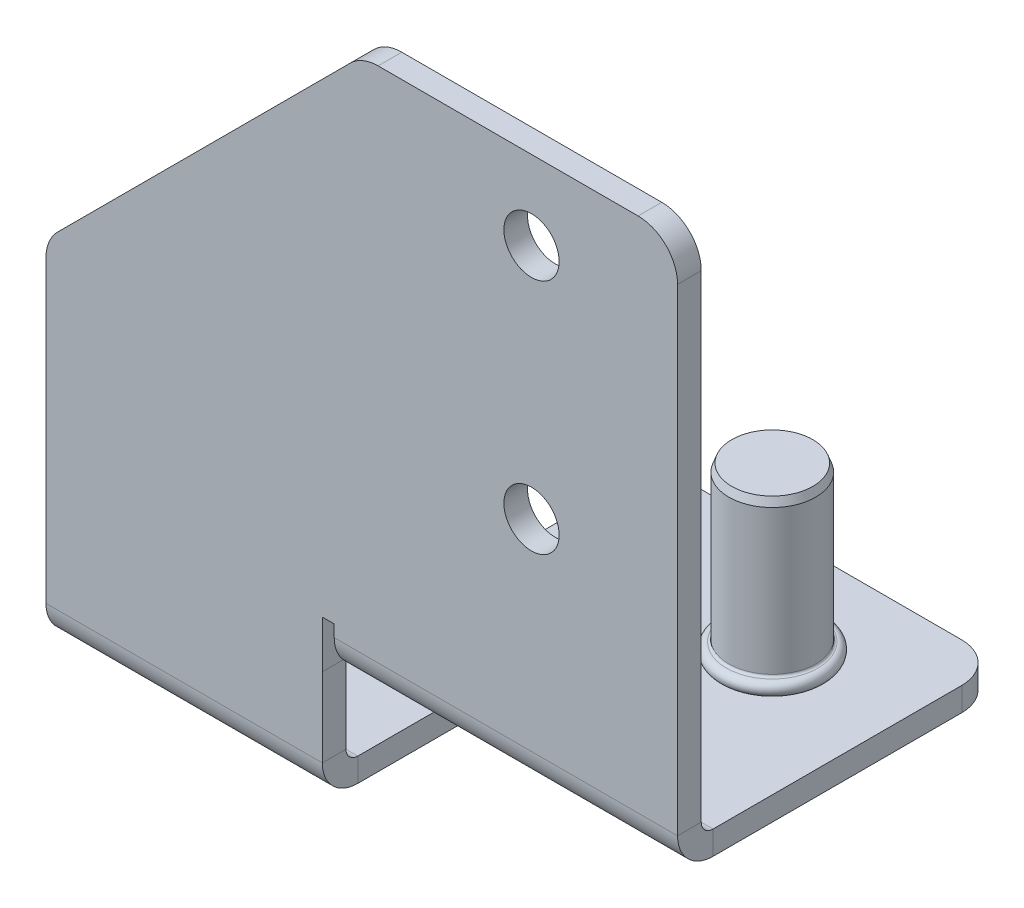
ISO-10303-21;
HEADER;
FILE_DESCRIPTION(('STEP AP214'),'2;1');
FILE_NAME('part.step','',(''),(''),'','','');
FILE_SCHEMA(('AUTOMOTIVE_DESIGN { 1 0 10303 214 1 1 1 1 }'));
ENDSEC;
DATA;
#1=APPLICATION_CONTEXT('core data for automotive mechanical design processes');
#2=APPLICATION_PROTOCOL_DEFINITION('international standard','automotive_design',2000,#1);
#3=PRODUCT_CONTEXT('',#1,'mechanical');
#4=PRODUCT('Part','Part','',(#3));
#5=PRODUCT_RELATED_PRODUCT_CATEGORY('part','',(#4));
#6=PRODUCT_DEFINITION_FORMATION('','',#4);
#7=PRODUCT_DEFINITION_CONTEXT('part definition',#1,'design');
#8=PRODUCT_DEFINITION('design','',#6,#7);
#9=PRODUCT_DEFINITION_SHAPE('','',#8);
#10=(LENGTH_UNIT() NAMED_UNIT(*) SI_UNIT(.MILLI.,.METRE.));
#11=(NAMED_UNIT(*) PLANE_ANGLE_UNIT() SI_UNIT($,.RADIAN.));
#12=(NAMED_UNIT(*) SI_UNIT($,.STERADIAN.) SOLID_ANGLE_UNIT());
#13=UNCERTAINTY_MEASURE_WITH_UNIT(LENGTH_MEASURE(1.E-05),#10,'distance_accuracy_value','');
#14=(GEOMETRIC_REPRESENTATION_CONTEXT(3) GLOBAL_UNCERTAINTY_ASSIGNED_CONTEXT((#13)) GLOBAL_UNIT_ASSIGNED_CONTEXT((#10,
#11,#12)) REPRESENTATION_CONTEXT('',''));
#15=CARTESIAN_POINT('',(0.,0.,0.));
#16=DIRECTION('',(0.,0.,1.));
#17=DIRECTION('',(1.,0.,0.));
#18=AXIS2_PLACEMENT_3D('',#15,#16,#17);
#19=CARTESIAN_POINT('',(25.,-13.3199999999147,-27.));
#20=DIRECTION('',(0.,-1.,0.));
#21=DIRECTION('',(0.,0.,1.));
#22=AXIS2_PLACEMENT_3D('',#19,#20,#21);
#23=CONICAL_SURFACE('',#22,3.15874999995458,1.04719755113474);
#24=CARTESIAN_POINT('',(24.9999999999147,-11.4962948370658,-27.));
#25=VERTEX_POINT('',#24);
#26=VERTEX_LOOP('',#25);
#27=FACE_BOUND('',#26,.T.);
#28=CARTESIAN_POINT('',(25.,-13.3200000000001,-27.));
#29=DIRECTION('',(0.,1.,0.));
#30=DIRECTION('',(0.,0.,-1.));
#31=AXIS2_PLACEMENT_3D('',#28,#29,#30);
#32=CIRCLE('',#31,3.15875);
#33=CARTESIAN_POINT('',(25.,-13.3200000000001,-30.15875));
#34=VERTEX_POINT('',#33);
#35=EDGE_CURVE('E125',#34,#34,#32,.F.);
#36=ORIENTED_EDGE('',*,*,#35,.T.);
#37=EDGE_LOOP('',(#36));
#38=FACE_BOUND('',#37,.T.);
#39=ADVANCED_FACE('F91',(#27,#38),#23,.F.);
#40=CARTESIAN_POINT('',(25.,-14.7976250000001,-27.));
#41=DIRECTION('',(0.,1.,0.));
#42=DIRECTION('',(0.,0.,-1.));
#43=AXIS2_PLACEMENT_3D('',#40,#41,#42);
#44=CYLINDRICAL_SURFACE('',#43,3.15875);
#45=CARTESIAN_POINT('',(25.,-16.275250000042,-27.));
#46=DIRECTION('',(0.,-1.,0.));
#47=DIRECTION('',(-1.,0.,0.));
#48=AXIS2_PLACEMENT_3D('',#45,#46,#47);
#49=CIRCLE('',#48,3.15874999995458);
#50=CARTESIAN_POINT('',(21.8412500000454,-16.275250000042,-27.));
#51=VERTEX_POINT('',#50);
#52=EDGE_CURVE('E127',#51,#51,#49,.T.);
#53=ORIENTED_EDGE('',*,*,#52,.T.);
#54=EDGE_LOOP('',(#53));
#55=FACE_BOUND('',#54,.T.);
#56=ORIENTED_EDGE('',*,*,#35,.F.);
#57=EDGE_LOOP('',(#56));
#58=FACE_BOUND('',#57,.T.);
#59=ADVANCED_FACE('F122',(#55,#58),#44,.F.);
#60=CARTESIAN_POINT('',(25.,-16.4399999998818,-27.));
#61=DIRECTION('',(0.,-1.,0.));
#62=DIRECTION('',(0.,0.,1.));
#63=AXIS2_PLACEMENT_3D('',#60,#61,#62);
#64=CONICAL_SURFACE('',#63,3.32349999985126,0.785398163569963);
#65=CARTESIAN_POINT('',(25.,-16.4400000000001,-27.));
#66=DIRECTION('',(0.,1.,0.));
#67=DIRECTION('',(0.,0.,-1.));
#68=AXIS2_PLACEMENT_3D('',#65,#66,#67);
#69=CIRCLE('',#68,3.3235);
#70=CARTESIAN_POINT('',(25.,-16.4400000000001,-30.3235));
#71=VERTEX_POINT('',#70);
#72=EDGE_CURVE('E130',#71,#71,#69,.F.);
#73=ORIENTED_EDGE('',*,*,#72,.T.);
#74=EDGE_LOOP('',(#73));
#75=FACE_BOUND('',#74,.T.);
#76=ORIENTED_EDGE('',*,*,#52,.F.);
#77=EDGE_LOOP('',(#76));
#78=FACE_BOUND('',#77,.T.);
#79=ADVANCED_FACE('F213',(#75,#78),#64,.F.);
#80=CARTESIAN_POINT('',(25.,-23.3817500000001,-27.));
#81=DIRECTION('',(0.,1.,0.));
#82=DIRECTION('',(0.,0.,-1.));
#83=AXIS2_PLACEMENT_3D('',#80,#81,#82);
#84=CYLINDRICAL_SURFACE('',#83,3.3235);
#85=CARTESIAN_POINT('',(25.,-30.2341448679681,-27.));
#86=DIRECTION('',(0.,-1.,0.));
#87=DIRECTION('',(-1.,0.,0.));
#88=AXIS2_PLACEMENT_3D('',#85,#86,#87);
#89=CIRCLE('',#88,3.3235000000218);
#90=CARTESIAN_POINT('',(21.6764999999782,-30.2341448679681,-27.));
#91=VERTEX_POINT('',#90);
#92=EDGE_CURVE('E208',#91,#91,#89,.T.);
#93=ORIENTED_EDGE('',*,*,#92,.T.);
#94=EDGE_LOOP('',(#93));
#95=FACE_BOUND('',#94,.T.);
#96=ORIENTED_EDGE('',*,*,#72,.F.);
#97=EDGE_LOOP('',(#96));
#98=FACE_BOUND('',#97,.T.);
#99=ADVANCED_FACE('F216',(#95,#98),#84,.F.);
#100=CARTESIAN_POINT('',(25.,-31.0000000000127,-27.));
#101=DIRECTION('',(0.,-1.,0.));
#102=DIRECTION('',(0.,0.,1.));
#103=AXIS2_PLACEMENT_3D('',#100,#101,#102);
#104=CONICAL_SURFACE('',#103,4.64999999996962,1.04719755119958);
#105=CARTESIAN_POINT('',(25.,-31.0000000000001,-27.));
#106=DIRECTION('',(0.,-1.,0.));
#107=DIRECTION('',(0.,0.,1.));
#108=AXIS2_PLACEMENT_3D('',#105,#106,#107);
#109=CIRCLE('',#108,4.65);
#110=CARTESIAN_POINT('',(25.,-31.0000000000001,-22.35));
#111=VERTEX_POINT('',#110);
#112=EDGE_CURVE('E148',#111,#111,#109,.T.);
#113=ORIENTED_EDGE('',*,*,#112,.T.);
#114=EDGE_LOOP('',(#113));
#115=FACE_BOUND('',#114,.T.);
#116=ORIENTED_EDGE('',*,*,#92,.F.);
#117=EDGE_LOOP('',(#116));
#118=FACE_BOUND('',#117,.T.);
#119=ADVANCED_FACE('F218',(#115,#118),#104,.F.);
#120=CARTESIAN_POINT('',(25.,-35.0000000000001,-27.));
#121=DIRECTION('',(0.,-1.,0.));
#122=DIRECTION('',(0.,0.,1.));
#123=AXIS2_PLACEMENT_3D('',#120,#121,#122);
#124=CYLINDRICAL_SURFACE('',#123,4.65);
#125=ORIENTED_EDGE('',*,*,#112,.F.);
#126=EDGE_LOOP('',(#125));
#127=FACE_BOUND('',#126,.T.);
#128=CARTESIAN_POINT('',(25.,-35.0000000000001,-27.));
#129=DIRECTION('',(0.,-1.,0.));
#130=DIRECTION('',(0.,0.,1.));
#131=AXIS2_PLACEMENT_3D('',#128,#129,#130);
#132=CIRCLE('',#131,4.65);
#133=CARTESIAN_POINT('',(25.,-35.0000000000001,-22.35));
#134=VERTEX_POINT('',#133);
#135=EDGE_CURVE('E145',#134,#134,#132,.T.);
#136=ORIENTED_EDGE('',*,*,#135,.T.);
#137=EDGE_LOOP('',(#136));
#138=FACE_BOUND('',#137,.T.);
#139=ADVANCED_FACE('F225',(#127,#138),#124,.F.);
#140=CARTESIAN_POINT('',(25.,-35.0000000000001,-27.));
#141=DIRECTION('',(0.,1.,0.));
#142=DIRECTION('',(0.,0.,-1.));
#143=AXIS2_PLACEMENT_3D('',#140,#141,#142);
#144=PLANE('',#143);
#145=ORIENTED_EDGE('',*,*,#135,.F.);
#146=EDGE_LOOP('',(#145));
#147=FACE_BOUND('',#146,.T.);
#148=CARTESIAN_POINT('',(25.,-34.999999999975,-27.));
#149=DIRECTION('',(0.,-1.,0.));
#150=DIRECTION('',(0.,0.,1.));
#151=AXIS2_PLACEMENT_3D('',#148,#149,#150);
#152=CIRCLE('',#151,5.99999999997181);
#153=CARTESIAN_POINT('',(25.,-34.999999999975,-21.0000000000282));
#154=VERTEX_POINT('',#153);
#155=EDGE_CURVE('E142',#154,#154,#152,.F.);
#156=ORIENTED_EDGE('',*,*,#155,.F.);
#157=EDGE_LOOP('',(#156));
#158=FACE_BOUND('',#157,.T.);
#159=ADVANCED_FACE('F286',(#147,#158),#144,.F.);
#160=CARTESIAN_POINT('',(25.,-34.999999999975,-27.));
#161=DIRECTION('',(0.,-1.,0.));
#162=DIRECTION('',(0.,0.,1.));
#163=AXIS2_PLACEMENT_3D('',#160,#161,#162);
#164=CONICAL_SURFACE('',#163,5.99999999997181,0.89605538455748);
#165=ORIENTED_EDGE('',*,*,#155,.T.);
#166=EDGE_LOOP('',(#165));
#167=FACE_BOUND('',#166,.T.);
#168=CARTESIAN_POINT('',(25.,-34.6000000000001,-27.));
#169=DIRECTION('',(0.,-1.,0.));
#170=DIRECTION('',(0.,0.,1.));
#171=AXIS2_PLACEMENT_3D('',#168,#169,#170);
#172=CIRCLE('',#171,5.5);
#173=CARTESIAN_POINT('',(25.,-34.6000000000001,-21.5));
#174=VERTEX_POINT('',#173);
#175=EDGE_CURVE('E141',#174,#174,#172,.F.);
#176=ORIENTED_EDGE('',*,*,#175,.F.);
#177=EDGE_LOOP('',(#176));
#178=FACE_BOUND('',#177,.T.);
#179=ADVANCED_FACE('F279',(#167,#178),#164,.T.);
#180=CARTESIAN_POINT('',(25.,-34.9000000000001,-27.));
#181=DIRECTION('',(0.,-1.,0.));
#182=DIRECTION('',(0.,0.,1.));
#183=AXIS2_PLACEMENT_3D('',#180,#181,#182);
#184=CYLINDRICAL_SURFACE('',#183,5.5);
#185=ORIENTED_EDGE('',*,*,#175,.T.);
#186=EDGE_LOOP('',(#185));
#187=FACE_BOUND('',#186,.T.);
#188=CARTESIAN_POINT('',(25.,-31.9000000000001,-27.));
#189=DIRECTION('',(0.,-1.,0.));
#190=DIRECTION('',(0.,0.,1.));
#191=AXIS2_PLACEMENT_3D('',#188,#189,#190);
#192=CIRCLE('',#191,5.5);
#193=CARTESIAN_POINT('',(25.,-31.9000000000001,-21.5));
#194=VERTEX_POINT('',#193);
#195=EDGE_CURVE('E138',#194,#194,#192,.F.);
#196=ORIENTED_EDGE('',*,*,#195,.F.);
#197=EDGE_LOOP('',(#196));
#198=FACE_BOUND('',#197,.T.);
#199=ADVANCED_FACE('F272',(#187,#198),#184,.T.);
#200=CARTESIAN_POINT('',(22.1,-31.9000000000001,-27.));
#201=DIRECTION('',(0.,-1.,0.));
#202=DIRECTION('',(0.,0.,1.));
#203=AXIS2_PLACEMENT_3D('',#200,#201,#202);
#204=PLANE('',#203);
#205=CARTESIAN_POINT('',(25.,-31.9000000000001,-27.));
#206=DIRECTION('',(0.,1.,0.));
#207=DIRECTION('',(0.,0.,1.));
#208=AXIS2_PLACEMENT_3D('',#205,#206,#207);
#209=CIRCLE('',#208,5.80000000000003);
#210=CARTESIAN_POINT('',(25.,-31.9000000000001,-21.1999999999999));
#211=VERTEX_POINT('',#210);
#212=CARTESIAN_POINT('',(25.,-31.9000000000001,-32.8));
#213=VERTEX_POINT('',#212);
#214=EDGE_CURVE('E110',#211,#213,#209,.T.);
#215=ORIENTED_EDGE('',*,*,#214,.F.);
#216=CARTESIAN_POINT('',(25.,-31.9000000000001,-27.));
#217=DIRECTION('',(0.,1.,0.));
#218=DIRECTION('',(-1.,0.,0.));
#219=AXIS2_PLACEMENT_3D('',#216,#217,#218);
#220=CIRCLE('',#219,5.80000000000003);
#221=CARTESIAN_POINT('',(19.2,-31.9000000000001,-27.));
#222=VERTEX_POINT('',#221);
#223=EDGE_CURVE('E150',#222,#211,#220,.T.);
#224=ORIENTED_EDGE('',*,*,#223,.F.);
#225=CARTESIAN_POINT('',(25.,-31.9000000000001,-27.));
#226=DIRECTION('',(0.,1.,0.));
#227=DIRECTION('',(0.,0.,-1.));
#228=AXIS2_PLACEMENT_3D('',#225,#226,#227);
#229=CIRCLE('',#228,5.80000000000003);
#230=EDGE_CURVE('E178',#213,#222,#229,.T.);
#231=ORIENTED_EDGE('',*,*,#230,.F.);
#232=EDGE_LOOP('',(#215,#224,#231));
#233=FACE_BOUND('',#232,.T.);
#234=ORIENTED_EDGE('',*,*,#195,.T.);
#235=EDGE_LOOP('',(#234));
#236=FACE_BOUND('',#235,.T.);
#237=ADVANCED_FACE('F167',(#233,#236),#204,.T.);
#238=CARTESIAN_POINT('',(25.,-31.0500000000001,-27.));
#239=DIRECTION('',(0.,-1.,0.));
#240=DIRECTION('',(0.,0.,1.));
#241=AXIS2_PLACEMENT_3D('',#238,#239,#240);
#242=TOROIDAL_SURFACE('',#241,5.80000000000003,0.85);
#243=ORIENTED_EDGE('',*,*,#214,.T.);
#244=ORIENTED_EDGE('',*,*,#230,.T.);
#245=ORIENTED_EDGE('',*,*,#223,.T.);
#246=EDGE_LOOP('',(#243,#244,#245));
#247=FACE_BOUND('',#246,.T.);
#248=CARTESIAN_POINT('',(25.,-30.2000000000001,-27.));
#249=DIRECTION('',(0.,-1.,0.));
#250=DIRECTION('',(0.,0.,1.));
#251=AXIS2_PLACEMENT_3D('',#248,#249,#250);
#252=CIRCLE('',#251,5.8);
#253=CARTESIAN_POINT('',(25.,-30.2000000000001,-21.2));
#254=VERTEX_POINT('',#253);
#255=EDGE_CURVE('E137',#254,#254,#252,.T.);
#256=ORIENTED_EDGE('',*,*,#255,.T.);
#257=EDGE_LOOP('',(#256));
#258=FACE_BOUND('',#257,.T.);
#259=ADVANCED_FACE('F155',(#247,#258),#242,.T.);
#260=CARTESIAN_POINT('',(25.,-10.6000000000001,-27.));
#261=DIRECTION('',(0.,1.,0.));
#262=DIRECTION('',(0.,0.,-1.));
#263=AXIS2_PLACEMENT_3D('',#260,#261,#262);
#264=PLANE('',#263);
#265=CARTESIAN_POINT('',(25.,-10.6000000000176,-27.));
#266=DIRECTION('',(0.,-1.,0.));
#267=DIRECTION('',(0.,0.,1.));
#268=AXIS2_PLACEMENT_3D('',#265,#266,#267);
#269=CIRCLE('',#268,5.13602976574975);
#270=CARTESIAN_POINT('',(25.,-10.6000000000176,-21.8639702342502));
#271=VERTEX_POINT('',#270);
#272=EDGE_CURVE('E134',#271,#271,#269,.T.);
#273=ORIENTED_EDGE('',*,*,#272,.F.);
#274=EDGE_LOOP('',(#273));
#275=FACE_BOUND('',#274,.T.);
#276=ADVANCED_FACE('F166',(#275),#264,.T.);
#277=CARTESIAN_POINT('',(25.,-29.9000000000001,-27.));
#278=DIRECTION('',(0.,-1.,0.));
#279=DIRECTION('',(0.,0.,1.));
#280=AXIS2_PLACEMENT_3D('',#277,#278,#279);
#281=TOROIDAL_SURFACE('',#280,5.80000000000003,0.299999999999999);
#282=ORIENTED_EDGE('',*,*,#255,.F.);
#283=EDGE_LOOP('',(#282));
#284=FACE_BOUND('',#283,.T.);
#285=CARTESIAN_POINT('',(25.,-29.9000000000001,-27.));
#286=DIRECTION('',(0.,-1.,0.));
#287=DIRECTION('',(0.,0.,1.));
#288=AXIS2_PLACEMENT_3D('',#285,#286,#287);
#289=CIRCLE('',#288,5.5);
#290=CARTESIAN_POINT('',(25.,-29.9000000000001,-21.5));
#291=VERTEX_POINT('',#290);
#292=EDGE_CURVE('E102',#291,#291,#289,.F.);
#293=ORIENTED_EDGE('',*,*,#292,.F.);
#294=EDGE_LOOP('',(#293));
#295=FACE_BOUND('',#294,.T.);
#296=ADVANCED_FACE('F237',(#284,#295),#281,.F.);
#297=CARTESIAN_POINT('',(25.,-11.5999999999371,-27.));
#298=DIRECTION('',(0.,-1.,0.));
#299=DIRECTION('',(0.,0.,1.));
#300=AXIS2_PLACEMENT_3D('',#297,#298,#299);
#301=CONICAL_SURFACE('',#300,5.49999999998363,0.349065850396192);
#302=ORIENTED_EDGE('',*,*,#272,.T.);
#303=EDGE_LOOP('',(#302));
#304=FACE_BOUND('',#303,.T.);
#305=CARTESIAN_POINT('',(25.,-11.6000000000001,-27.));
#306=DIRECTION('',(0.,-1.,0.));
#307=DIRECTION('',(0.,0.,1.));
#308=AXIS2_PLACEMENT_3D('',#305,#306,#307);
#309=CIRCLE('',#308,5.5);
#310=CARTESIAN_POINT('',(25.,-11.6000000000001,-21.5));
#311=VERTEX_POINT('',#310);
#312=EDGE_CURVE('E14',#311,#311,#309,.T.);
#313=ORIENTED_EDGE('',*,*,#312,.F.);
#314=EDGE_LOOP('',(#313));
#315=FACE_BOUND('',#314,.T.);
#316=ADVANCED_FACE('F231',(#304,#315),#301,.T.);
#317=CARTESIAN_POINT('',(25.,-34.9000000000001,-27.));
#318=DIRECTION('',(0.,-1.,0.));
#319=DIRECTION('',(0.,0.,1.));
#320=AXIS2_PLACEMENT_3D('',#317,#318,#319);
#321=CYLINDRICAL_SURFACE('',#320,5.5);
#322=ORIENTED_EDGE('',*,*,#292,.T.);
#323=EDGE_LOOP('',(#322));
#324=FACE_BOUND('',#323,.T.);
#325=ORIENTED_EDGE('',*,*,#312,.T.);
#326=EDGE_LOOP('',(#325));
#327=FACE_BOUND('',#326,.T.);
#328=ADVANCED_FACE('F229',(#324,#327),#321,.T.);
#329=CLOSED_SHELL('',(#39,#59,#79,#99,#119,#139,#159,#179,#199,#237,#259,#276,#296,#316,#328));
#330=MANIFOLD_SOLID_BREP('B2',#329);
#331=CARTESIAN_POINT('',(0.,0.,-3.));
#332=DIRECTION('',(0.,0.,-1.));
#333=DIRECTION('',(-1.,0.,0.));
#334=AXIS2_PLACEMENT_3D('',#331,#332,#333);
#335=PLANE('',#334);
#336=CARTESIAN_POINT('',(21.5,25.,-3.));
#337=DIRECTION('',(0.,0.,-1.));
#338=DIRECTION('',(-1.,0.,0.));
#339=AXIS2_PLACEMENT_3D('',#336,#337,#338);
#340=CIRCLE('',#339,3.49999999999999);
#341=CARTESIAN_POINT('',(18.,25.,-3.));
#342=VERTEX_POINT('',#341);
#343=EDGE_CURVE('E750',#342,#342,#340,.T.);
#344=ORIENTED_EDGE('',*,*,#343,.F.);
#345=EDGE_LOOP('',(#344));
#346=FACE_BOUND('',#345,.T.);
#347=CARTESIAN_POINT('',(21.5,-5.,-3.));
#348=DIRECTION('',(0.,0.,-1.));
#349=DIRECTION('',(-1.,0.,0.));
#350=AXIS2_PLACEMENT_3D('',#347,#348,#349);
#351=CIRCLE('',#350,3.49999999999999);
#352=CARTESIAN_POINT('',(18.,-5.,-3.));
#353=VERTEX_POINT('',#352);
#354=EDGE_CURVE('E756',#353,#353,#351,.T.);
#355=ORIENTED_EDGE('',*,*,#354,.F.);
#356=EDGE_LOOP('',(#355));
#357=FACE_BOUND('',#356,.T.);
#358=DIRECTION('',(-0.707106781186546,-0.707106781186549,0.));
#359=VECTOR('',#358,1.);
#360=CARTESIAN_POINT('',(-17.5,17.5,-3.));
#361=LINE('',#360,#359);
#362=CARTESIAN_POINT('',(-38.5355339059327,-3.53553390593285,-3.));
#363=VERTEX_POINT('',#362);
#364=CARTESIAN_POINT('',(-1.46446609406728,33.5355339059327,-3.));
#365=VERTEX_POINT('',#364);
#366=EDGE_CURVE('E791',#363,#365,#361,.F.);
#367=ORIENTED_EDGE('',*,*,#366,.T.);
#368=CARTESIAN_POINT('',(2.07106781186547,30.,-3.));
#369=DIRECTION('',(0.,0.,-1.));
#370=DIRECTION('',(-1.,0.,0.));
#371=AXIS2_PLACEMENT_3D('',#368,#369,#370);
#372=CIRCLE('',#371,5.);
#373=CARTESIAN_POINT('',(2.07106781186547,35.,-3.));
#374=VERTEX_POINT('',#373);
#375=EDGE_CURVE('E849',#365,#374,#372,.T.);
#376=ORIENTED_EDGE('',*,*,#375,.T.);
#377=DIRECTION('',(-1.,0.,0.));
#378=VECTOR('',#377,1.);
#379=CARTESIAN_POINT('',(-40.,35.,-3.));
#380=LINE('',#379,#378);
#381=CARTESIAN_POINT('',(35.,35.,-3.));
#382=VERTEX_POINT('',#381);
#383=EDGE_CURVE('E763',#382,#374,#380,.T.);
#384=ORIENTED_EDGE('',*,*,#383,.F.);
#385=CARTESIAN_POINT('',(35.,30.,-3.));
#386=DIRECTION('',(0.,0.,-1.));
#387=DIRECTION('',(-1.,0.,0.));
#388=AXIS2_PLACEMENT_3D('',#385,#386,#387);
#389=CIRCLE('',#388,5.);
#390=CARTESIAN_POINT('',(40.,30.,-3.));
#391=VERTEX_POINT('',#390);
#392=EDGE_CURVE('E847',#382,#391,#389,.T.);
#393=ORIENTED_EDGE('',*,*,#392,.T.);
#394=DIRECTION('',(0.,1.,0.));
#395=VECTOR('',#394,1.);
#396=CARTESIAN_POINT('',(40.,-35.,-3.));
#397=LINE('',#396,#395);
#398=CARTESIAN_POINT('',(40.,-30.5,-3.));
#399=VERTEX_POINT('',#398);
#400=EDGE_CURVE('E760',#399,#391,#397,.T.);
#401=ORIENTED_EDGE('',*,*,#400,.F.);
#402=DIRECTION('',(-1.,0.,0.));
#403=VECTOR('',#402,1.);
#404=CARTESIAN_POINT('',(-3.49,-30.5,-3.));
#405=LINE('',#404,#403);
#406=CARTESIAN_POINT('',(-3.49,-30.5,-3.));
#407=VERTEX_POINT('',#406);
#408=EDGE_CURVE('E671',#407,#399,#405,.F.);
#409=ORIENTED_EDGE('',*,*,#408,.F.);
#410=DIRECTION('',(0.,-1.,0.));
#411=VECTOR('',#410,1.);
#412=CARTESIAN_POINT('',(-3.49,-29.,-3.));
#413=LINE('',#412,#411);
#414=CARTESIAN_POINT('',(-3.49,-29.,-3.));
#415=VERTEX_POINT('',#414);
#416=EDGE_CURVE('E738',#415,#407,#413,.T.);
#417=ORIENTED_EDGE('',*,*,#416,.F.);
#418=DIRECTION('',(1.,0.,0.));
#419=VECTOR('',#418,1.);
#420=CARTESIAN_POINT('',(-4.99,-29.,-3.));
#421=LINE('',#420,#419);
#422=CARTESIAN_POINT('',(-4.99,-29.,-3.));
#423=VERTEX_POINT('',#422);
#424=EDGE_CURVE('E734',#423,#415,#421,.T.);
#425=ORIENTED_EDGE('',*,*,#424,.F.);
#426=DIRECTION('',(0.,1.,0.));
#427=VECTOR('',#426,1.);
#428=CARTESIAN_POINT('',(-4.99,-35.,-3.));
#429=LINE('',#428,#427);
#430=CARTESIAN_POINT('',(-4.99,-35.,-3.));
#431=VERTEX_POINT('',#430);
#432=EDGE_CURVE('E729',#431,#423,#429,.T.);
#433=ORIENTED_EDGE('',*,*,#432,.F.);
#434=DIRECTION('',(1.,0.,0.));
#435=VECTOR('',#434,1.);
#436=CARTESIAN_POINT('',(-4.99999999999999,-35.,-3.));
#437=LINE('',#436,#435);
#438=CARTESIAN_POINT('',(-4.99999999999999,-35.,-3.));
#439=VERTEX_POINT('',#438);
#440=EDGE_CURVE('E771',#439,#431,#437,.T.);
#441=ORIENTED_EDGE('',*,*,#440,.F.);
#442=DIRECTION('',(0.,1.,0.));
#443=VECTOR('',#442,1.);
#444=CARTESIAN_POINT('',(-4.99999999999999,-35.,-3.));
#445=LINE('',#444,#443);
#446=CARTESIAN_POINT('',(-4.99999999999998,-45.,-3.));
#447=VERTEX_POINT('',#446);
#448=EDGE_CURVE('E769',#447,#439,#445,.T.);
#449=ORIENTED_EDGE('',*,*,#448,.F.);
#450=DIRECTION('',(-1.,0.,0.));
#451=VECTOR('',#450,1.);
#452=CARTESIAN_POINT('',(-40.,-45.,-3.));
#453=LINE('',#452,#451);
#454=CARTESIAN_POINT('',(-40.,-45.,-3.));
#455=VERTEX_POINT('',#454);
#456=EDGE_CURVE('E718',#455,#447,#453,.F.);
#457=ORIENTED_EDGE('',*,*,#456,.F.);
#458=DIRECTION('',(0.,-1.,0.));
#459=VECTOR('',#458,1.);
#460=CARTESIAN_POINT('',(-40.,-35.,-3.));
#461=LINE('',#460,#459);
#462=CARTESIAN_POINT('',(-40.,-7.07106781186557,-3.));
#463=VERTEX_POINT('',#462);
#464=EDGE_CURVE('E767',#463,#455,#461,.T.);
#465=ORIENTED_EDGE('',*,*,#464,.F.);
#466=CARTESIAN_POINT('',(-35.,-7.07106781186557,-3.));
#467=DIRECTION('',(0.,0.,-1.));
#468=DIRECTION('',(-1.,0.,0.));
#469=AXIS2_PLACEMENT_3D('',#466,#467,#468);
#470=CIRCLE('',#469,5.);
#471=EDGE_CURVE('E845',#463,#363,#470,.T.);
#472=ORIENTED_EDGE('',*,*,#471,.T.);
#473=EDGE_LOOP('',(#367,#376,#384,#393,#401,#409,#417,#425,#433,#441,#449,#457,#465,#472));
#474=FACE_BOUND('',#473,.T.);
#475=ADVANCED_FACE('F443',(#346,#357,#474),#335,.T.);
#476=CARTESIAN_POINT('',(0.,0.,0.));
#477=DIRECTION('',(0.,0.,-1.));
#478=DIRECTION('',(-1.,0.,0.));
#479=AXIS2_PLACEMENT_3D('',#476,#477,#478);
#480=PLANE('',#479);
#481=CARTESIAN_POINT('',(21.5,25.,0.));
#482=DIRECTION('',(0.,0.,1.));
#483=DIRECTION('',(1.,0.,0.));
#484=AXIS2_PLACEMENT_3D('',#481,#482,#483);
#485=CIRCLE('',#484,3.5);
#486=CARTESIAN_POINT('',(25.,25.,0.));
#487=VERTEX_POINT('',#486);
#488=EDGE_CURVE('E747',#487,#487,#485,.T.);
#489=ORIENTED_EDGE('',*,*,#488,.F.);
#490=EDGE_LOOP('',(#489));
#491=FACE_BOUND('',#490,.T.);
#492=CARTESIAN_POINT('',(21.5,-5.,0.));
#493=DIRECTION('',(0.,0.,1.));
#494=DIRECTION('',(1.,0.,0.));
#495=AXIS2_PLACEMENT_3D('',#492,#493,#494);
#496=CIRCLE('',#495,3.5);
#497=CARTESIAN_POINT('',(25.,-5.,0.));
#498=VERTEX_POINT('',#497);
#499=EDGE_CURVE('E753',#498,#498,#496,.T.);
#500=ORIENTED_EDGE('',*,*,#499,.F.);
#501=EDGE_LOOP('',(#500));
#502=FACE_BOUND('',#501,.T.);
#503=DIRECTION('',(-1.,0.,0.));
#504=VECTOR('',#503,1.);
#505=CARTESIAN_POINT('',(-40.,35.,0.));
#506=LINE('',#505,#504);
#507=CARTESIAN_POINT('',(35.,35.,0.));
#508=VERTEX_POINT('',#507);
#509=CARTESIAN_POINT('',(2.07106781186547,35.,0.));
#510=VERTEX_POINT('',#509);
#511=EDGE_CURVE('E777',#508,#510,#506,.T.);
#512=ORIENTED_EDGE('',*,*,#511,.T.);
#513=CARTESIAN_POINT('',(2.07106781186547,30.,0.));
#514=DIRECTION('',(0.,0.,-1.));
#515=DIRECTION('',(-1.,0.,0.));
#516=AXIS2_PLACEMENT_3D('',#513,#514,#515);
#517=CIRCLE('',#516,5.);
#518=CARTESIAN_POINT('',(-1.46446609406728,33.5355339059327,0.));
#519=VERTEX_POINT('',#518);
#520=EDGE_CURVE('E839',#510,#519,#517,.F.);
#521=ORIENTED_EDGE('',*,*,#520,.T.);
#522=DIRECTION('',(0.707106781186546,0.707106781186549,0.));
#523=VECTOR('',#522,1.);
#524=CARTESIAN_POINT('',(0.,35.,0.));
#525=LINE('',#524,#523);
#526=CARTESIAN_POINT('',(-38.5355339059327,-3.53553390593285,0.));
#527=VERTEX_POINT('',#526);
#528=EDGE_CURVE('E788',#519,#527,#525,.F.);
#529=ORIENTED_EDGE('',*,*,#528,.T.);
#530=CARTESIAN_POINT('',(-35.,-7.07106781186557,0.));
#531=DIRECTION('',(0.,0.,-1.));
#532=DIRECTION('',(-1.,0.,0.));
#533=AXIS2_PLACEMENT_3D('',#530,#531,#532);
#534=CIRCLE('',#533,5.);
#535=CARTESIAN_POINT('',(-40.,-7.07106781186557,0.));
#536=VERTEX_POINT('',#535);
#537=EDGE_CURVE('E835',#527,#536,#534,.F.);
#538=ORIENTED_EDGE('',*,*,#537,.T.);
#539=DIRECTION('',(0.,-1.,0.));
#540=VECTOR('',#539,1.);
#541=CARTESIAN_POINT('',(-40.,-35.,0.));
#542=LINE('',#541,#540);
#543=CARTESIAN_POINT('',(-40.,-45.,0.));
#544=VERTEX_POINT('',#543);
#545=EDGE_CURVE('E780',#536,#544,#542,.T.);
#546=ORIENTED_EDGE('',*,*,#545,.T.);
#547=DIRECTION('',(-1.,0.,0.));
#548=VECTOR('',#547,1.);
#549=CARTESIAN_POINT('',(-40.,-45.,0.));
#550=LINE('',#549,#548);
#551=CARTESIAN_POINT('',(-4.99999999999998,-45.,0.));
#552=VERTEX_POINT('',#551);
#553=EDGE_CURVE('E706',#544,#552,#550,.F.);
#554=ORIENTED_EDGE('',*,*,#553,.T.);
#555=DIRECTION('',(0.,1.,0.));
#556=VECTOR('',#555,1.);
#557=CARTESIAN_POINT('',(-4.99999999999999,-35.,0.));
#558=LINE('',#557,#556);
#559=CARTESIAN_POINT('',(-4.99999999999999,-35.,0.));
#560=VERTEX_POINT('',#559);
#561=EDGE_CURVE('E782',#552,#560,#558,.T.);
#562=ORIENTED_EDGE('',*,*,#561,.T.);
#563=DIRECTION('',(1.,0.,0.));
#564=VECTOR('',#563,1.);
#565=CARTESIAN_POINT('',(-4.99999999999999,-35.,0.));
#566=LINE('',#565,#564);
#567=CARTESIAN_POINT('',(-4.99,-35.,0.));
#568=VERTEX_POINT('',#567);
#569=EDGE_CURVE('E764',#560,#568,#566,.T.);
#570=ORIENTED_EDGE('',*,*,#569,.T.);
#571=DIRECTION('',(0.,-1.,0.));
#572=VECTOR('',#571,1.);
#573=CARTESIAN_POINT('',(-4.99,0.,0.));
#574=LINE('',#573,#572);
#575=CARTESIAN_POINT('',(-4.99,-29.,0.));
#576=VERTEX_POINT('',#575);
#577=EDGE_CURVE('E732',#576,#568,#574,.T.);
#578=ORIENTED_EDGE('',*,*,#577,.F.);
#579=DIRECTION('',(-1.,0.,0.));
#580=VECTOR('',#579,1.);
#581=CARTESIAN_POINT('',(0.,-29.,0.));
#582=LINE('',#581,#580);
#583=CARTESIAN_POINT('',(-3.49,-29.,0.));
#584=VERTEX_POINT('',#583);
#585=EDGE_CURVE('E796',#584,#576,#582,.T.);
#586=ORIENTED_EDGE('',*,*,#585,.F.);
#587=DIRECTION('',(0.,1.,0.));
#588=VECTOR('',#587,1.);
#589=CARTESIAN_POINT('',(-3.49,0.,0.));
#590=LINE('',#589,#588);
#591=CARTESIAN_POINT('',(-3.49,-30.5,0.));
#592=VERTEX_POINT('',#591);
#593=EDGE_CURVE('E794',#592,#584,#590,.T.);
#594=ORIENTED_EDGE('',*,*,#593,.F.);
#595=DIRECTION('',(-1.,0.,0.));
#596=VECTOR('',#595,1.);
#597=CARTESIAN_POINT('',(-3.49,-30.5,0.));
#598=LINE('',#597,#596);
#599=CARTESIAN_POINT('',(40.,-30.5,0.));
#600=VERTEX_POINT('',#599);
#601=EDGE_CURVE('E638',#592,#600,#598,.F.);
#602=ORIENTED_EDGE('',*,*,#601,.T.);
#603=DIRECTION('',(0.,1.,0.));
#604=VECTOR('',#603,1.);
#605=CARTESIAN_POINT('',(40.,-35.,0.));
#606=LINE('',#605,#604);
#607=CARTESIAN_POINT('',(40.,30.,0.));
#608=VERTEX_POINT('',#607);
#609=EDGE_CURVE('E759',#600,#608,#606,.T.);
#610=ORIENTED_EDGE('',*,*,#609,.T.);
#611=CARTESIAN_POINT('',(35.,30.,0.));
#612=DIRECTION('',(0.,0.,-1.));
#613=DIRECTION('',(-1.,0.,0.));
#614=AXIS2_PLACEMENT_3D('',#611,#612,#613);
#615=CIRCLE('',#614,5.);
#616=EDGE_CURVE('E837',#608,#508,#615,.F.);
#617=ORIENTED_EDGE('',*,*,#616,.T.);
#618=EDGE_LOOP('',(#512,#521,#529,#538,#546,#554,#562,#570,#578,#586,#594,#602,#610,#617));
#619=FACE_BOUND('',#618,.T.);
#620=ADVANCED_FACE('F879',(#491,#502,#619),#480,.F.);
#621=CARTESIAN_POINT('',(-4.99999999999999,-35.,-3.));
#622=DIRECTION('',(0.,-1.,0.));
#623=DIRECTION('',(0.,0.,-1.));
#624=AXIS2_PLACEMENT_3D('',#621,#622,#623);
#625=PLANE('',#624);
#626=ORIENTED_EDGE('',*,*,#440,.T.);
#627=DIRECTION('',(0.,0.,1.));
#628=VECTOR('',#627,1.);
#629=CARTESIAN_POINT('',(-4.99,-35.,-3.));
#630=LINE('',#629,#628);
#631=EDGE_CURVE('E733',#431,#568,#630,.T.);
#632=ORIENTED_EDGE('',*,*,#631,.T.);
#633=ORIENTED_EDGE('',*,*,#569,.F.);
#634=DIRECTION('',(0.,0.,1.));
#635=VECTOR('',#634,1.);
#636=CARTESIAN_POINT('',(-4.99999999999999,-35.,-3.));
#637=LINE('',#636,#635);
#638=EDGE_CURVE('E774',#439,#560,#637,.T.);
#639=ORIENTED_EDGE('',*,*,#638,.F.);
#640=EDGE_LOOP('',(#626,#632,#633,#639));
#641=FACE_BOUND('',#640,.T.);
#642=ADVANCED_FACE('F885',(#641),#625,.T.);
#643=CARTESIAN_POINT('',(-40.,-35.,-3.));
#644=DIRECTION('',(-1.,0.,0.));
#645=DIRECTION('',(0.,0.,1.));
#646=AXIS2_PLACEMENT_3D('',#643,#644,#645);
#647=PLANE('',#646);
#648=ORIENTED_EDGE('',*,*,#545,.F.);
#649=DIRECTION('',(0.,0.,1.));
#650=VECTOR('',#649,1.);
#651=CARTESIAN_POINT('',(-40.,-7.07106781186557,-3.));
#652=LINE('',#651,#650);
#653=EDGE_CURVE('E89',#536,#463,#652,.F.);
#654=ORIENTED_EDGE('',*,*,#653,.T.);
#655=ORIENTED_EDGE('',*,*,#464,.T.);
#656=DIRECTION('',(0.,0.,1.));
#657=VECTOR('',#656,1.);
#658=CARTESIAN_POINT('',(-40.,-45.,-3.));
#659=LINE('',#658,#657);
#660=EDGE_CURVE('E712',#455,#544,#659,.T.);
#661=ORIENTED_EDGE('',*,*,#660,.T.);
#662=EDGE_LOOP('',(#648,#654,#655,#661));
#663=FACE_BOUND('',#662,.T.);
#664=ADVANCED_FACE('F896',(#663),#647,.T.);
#665=CARTESIAN_POINT('',(40.,-35.,-3.));
#666=DIRECTION('',(1.,0.,0.));
#667=DIRECTION('',(0.,0.,-1.));
#668=AXIS2_PLACEMENT_3D('',#665,#666,#667);
#669=PLANE('',#668);
#670=ORIENTED_EDGE('',*,*,#400,.T.);
#671=DIRECTION('',(0.,0.,1.));
#672=VECTOR('',#671,1.);
#673=CARTESIAN_POINT('',(40.,30.,-3.));
#674=LINE('',#673,#672);
#675=EDGE_CURVE('E851',#391,#608,#674,.T.);
#676=ORIENTED_EDGE('',*,*,#675,.T.);
#677=ORIENTED_EDGE('',*,*,#609,.F.);
#678=DIRECTION('',(0.,0.,1.));
#679=VECTOR('',#678,1.);
#680=CARTESIAN_POINT('',(40.,-30.5,-3.));
#681=LINE('',#680,#679);
#682=EDGE_CURVE('E675',#399,#600,#681,.T.);
#683=ORIENTED_EDGE('',*,*,#682,.F.);
#684=EDGE_LOOP('',(#670,#676,#677,#683));
#685=FACE_BOUND('',#684,.T.);
#686=ADVANCED_FACE('F902',(#685),#669,.T.);
#687=CARTESIAN_POINT('',(-4.99999999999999,-35.,-3.));
#688=DIRECTION('',(1.,0.,0.));
#689=DIRECTION('',(0.,1.,0.));
#690=AXIS2_PLACEMENT_3D('',#687,#688,#689);
#691=PLANE('',#690);
#692=DIRECTION('',(0.,0.,1.));
#693=VECTOR('',#692,1.);
#694=CARTESIAN_POINT('',(-4.99999999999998,-45.,-3.));
#695=LINE('',#694,#693);
#696=EDGE_CURVE('E723',#447,#552,#695,.T.);
#697=ORIENTED_EDGE('',*,*,#696,.F.);
#698=ORIENTED_EDGE('',*,*,#448,.T.);
#699=ORIENTED_EDGE('',*,*,#638,.T.);
#700=ORIENTED_EDGE('',*,*,#561,.F.);
#701=EDGE_LOOP('',(#697,#698,#699,#700));
#702=FACE_BOUND('',#701,.T.);
#703=ADVANCED_FACE('F898',(#702),#691,.T.);
#704=CARTESIAN_POINT('',(-40.,35.,-3.));
#705=DIRECTION('',(0.,1.,0.));
#706=DIRECTION('',(0.,0.,1.));
#707=AXIS2_PLACEMENT_3D('',#704,#705,#706);
#708=PLANE('',#707);
#709=ORIENTED_EDGE('',*,*,#383,.T.);
#710=DIRECTION('',(0.,0.,-1.));
#711=VECTOR('',#710,1.);
#712=CARTESIAN_POINT('',(2.07106781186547,35.,-3.));
#713=LINE('',#712,#711);
#714=EDGE_CURVE('E832',#374,#510,#713,.F.);
#715=ORIENTED_EDGE('',*,*,#714,.T.);
#716=ORIENTED_EDGE('',*,*,#511,.F.);
#717=DIRECTION('',(0.,0.,1.));
#718=VECTOR('',#717,1.);
#719=CARTESIAN_POINT('',(35.,35.,-3.));
#720=LINE('',#719,#718);
#721=EDGE_CURVE('E830',#508,#382,#720,.F.);
#722=ORIENTED_EDGE('',*,*,#721,.T.);
#723=EDGE_LOOP('',(#709,#715,#716,#722));
#724=FACE_BOUND('',#723,.T.);
#725=ADVANCED_FACE('F901',(#724),#708,.T.);
#726=CARTESIAN_POINT('',(21.5,-5.,0.));
#727=DIRECTION('',(0.,0.,1.));
#728=DIRECTION('',(1.,0.,0.));
#729=AXIS2_PLACEMENT_3D('',#726,#727,#728);
#730=CYLINDRICAL_SURFACE('',#729,3.49999999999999);
#731=ORIENTED_EDGE('',*,*,#354,.T.);
#732=EDGE_LOOP('',(#731));
#733=FACE_BOUND('',#732,.T.);
#734=ORIENTED_EDGE('',*,*,#499,.T.);
#735=EDGE_LOOP('',(#734));
#736=FACE_BOUND('',#735,.T.);
#737=ADVANCED_FACE('F891',(#733,#736),#730,.F.);
#738=CARTESIAN_POINT('',(21.5,25.,0.));
#739=DIRECTION('',(0.,0.,1.));
#740=DIRECTION('',(1.,0.,0.));
#741=AXIS2_PLACEMENT_3D('',#738,#739,#740);
#742=CYLINDRICAL_SURFACE('',#741,3.49999999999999);
#743=ORIENTED_EDGE('',*,*,#343,.T.);
#744=EDGE_LOOP('',(#743));
#745=FACE_BOUND('',#744,.T.);
#746=ORIENTED_EDGE('',*,*,#488,.T.);
#747=EDGE_LOOP('',(#746));
#748=FACE_BOUND('',#747,.T.);
#749=ADVANCED_FACE('F917',(#745,#748),#742,.F.);
#750=CARTESIAN_POINT('',(0.,35.,-3.));
#751=DIRECTION('',(0.707106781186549,-0.707106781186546,0.));
#752=DIRECTION('',(0.,0.,1.));
#753=AXIS2_PLACEMENT_3D('',#750,#751,#752);
#754=PLANE('',#753);
#755=ORIENTED_EDGE('',*,*,#528,.F.);
#756=DIRECTION('',(0.,0.,1.));
#757=VECTOR('',#756,1.);
#758=CARTESIAN_POINT('',(-1.46446609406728,33.5355339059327,-3.));
#759=LINE('',#758,#757);
#760=EDGE_CURVE('E843',#519,#365,#759,.F.);
#761=ORIENTED_EDGE('',*,*,#760,.T.);
#762=ORIENTED_EDGE('',*,*,#366,.F.);
#763=DIRECTION('',(0.,0.,-1.));
#764=VECTOR('',#763,1.);
#765=CARTESIAN_POINT('',(-38.5355339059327,-3.53553390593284,-3.));
#766=LINE('',#765,#764);
#767=EDGE_CURVE('E841',#363,#527,#766,.F.);
#768=ORIENTED_EDGE('',*,*,#767,.T.);
#769=EDGE_LOOP('',(#755,#761,#762,#768));
#770=FACE_BOUND('',#769,.T.);
#771=ADVANCED_FACE('F913',(#770),#754,.F.);
#772=CARTESIAN_POINT('',(-4.99,-29.,-3.));
#773=DIRECTION('',(0.,-1.,0.));
#774=DIRECTION('',(0.,0.,-1.));
#775=AXIS2_PLACEMENT_3D('',#772,#773,#774);
#776=PLANE('',#775);
#777=DIRECTION('',(0.,0.,1.));
#778=VECTOR('',#777,1.);
#779=CARTESIAN_POINT('',(-3.49,-29.,-3.));
#780=LINE('',#779,#778);
#781=EDGE_CURVE('E726',#415,#584,#780,.T.);
#782=ORIENTED_EDGE('',*,*,#781,.T.);
#783=ORIENTED_EDGE('',*,*,#585,.T.);
#784=DIRECTION('',(0.,0.,1.));
#785=VECTOR('',#784,1.);
#786=CARTESIAN_POINT('',(-4.99,-29.,-3.));
#787=LINE('',#786,#785);
#788=EDGE_CURVE('E737',#423,#576,#787,.T.);
#789=ORIENTED_EDGE('',*,*,#788,.F.);
#790=ORIENTED_EDGE('',*,*,#424,.T.);
#791=EDGE_LOOP('',(#782,#783,#789,#790));
#792=FACE_BOUND('',#791,.T.);
#793=ADVANCED_FACE('F916',(#792),#776,.T.);
#794=CARTESIAN_POINT('',(-3.49,-29.,-3.));
#795=DIRECTION('',(-1.,0.,0.));
#796=DIRECTION('',(0.,0.,1.));
#797=AXIS2_PLACEMENT_3D('',#794,#795,#796);
#798=PLANE('',#797);
#799=DIRECTION('',(0.,0.,1.));
#800=VECTOR('',#799,1.);
#801=CARTESIAN_POINT('',(-3.49,-30.5,-3.));
#802=LINE('',#801,#800);
#803=EDGE_CURVE('E667',#407,#592,#802,.T.);
#804=ORIENTED_EDGE('',*,*,#803,.T.);
#805=ORIENTED_EDGE('',*,*,#593,.T.);
#806=ORIENTED_EDGE('',*,*,#781,.F.);
#807=ORIENTED_EDGE('',*,*,#416,.T.);
#808=EDGE_LOOP('',(#804,#805,#806,#807));
#809=FACE_BOUND('',#808,.T.);
#810=ADVANCED_FACE('F1044',(#809),#798,.T.);
#811=CARTESIAN_POINT('',(-4.99,-35.,-3.));
#812=DIRECTION('',(1.,0.,0.));
#813=DIRECTION('',(0.,0.,-1.));
#814=AXIS2_PLACEMENT_3D('',#811,#812,#813);
#815=PLANE('',#814);
#816=ORIENTED_EDGE('',*,*,#788,.T.);
#817=ORIENTED_EDGE('',*,*,#577,.T.);
#818=ORIENTED_EDGE('',*,*,#631,.F.);
#819=ORIENTED_EDGE('',*,*,#432,.T.);
#820=EDGE_LOOP('',(#816,#817,#818,#819));
#821=FACE_BOUND('',#820,.T.);
#822=ADVANCED_FACE('F1039',(#821),#815,.T.);
#823=CARTESIAN_POINT('',(-4.99999999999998,-45.,-4.5));
#824=DIRECTION('',(1.,0.,0.));
#825=DIRECTION('',(0.,0.,-1.));
#826=AXIS2_PLACEMENT_3D('',#823,#824,#825);
#827=PLANE('',#826);
#828=DIRECTION('',(0.,-1.,0.));
#829=VECTOR('',#828,1.);
#830=CARTESIAN_POINT('',(-4.99999999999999,-49.5,-4.49999999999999));
#831=LINE('',#830,#829);
#832=CARTESIAN_POINT('',(-4.99999999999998,-46.5,-4.5));
#833=VERTEX_POINT('',#832);
#834=CARTESIAN_POINT('',(-4.99999999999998,-49.5,-4.49999999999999));
#835=VERTEX_POINT('',#834);
#836=EDGE_CURVE('E678',#833,#835,#831,.T.);
#837=ORIENTED_EDGE('',*,*,#836,.F.);
#838=CARTESIAN_POINT('',(-4.99999999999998,-45.,-4.5));
#839=DIRECTION('',(-1.,0.,0.));
#840=DIRECTION('',(0.,0.,1.));
#841=AXIS2_PLACEMENT_3D('',#838,#839,#840);
#842=CIRCLE('',#841,1.5);
#843=EDGE_CURVE('E715',#447,#833,#842,.F.);
#844=ORIENTED_EDGE('',*,*,#843,.F.);
#845=ORIENTED_EDGE('',*,*,#696,.T.);
#846=CARTESIAN_POINT('',(-4.99999999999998,-45.,-4.5));
#847=DIRECTION('',(-1.,0.,0.));
#848=DIRECTION('',(0.,0.,1.));
#849=AXIS2_PLACEMENT_3D('',#846,#847,#848);
#850=CIRCLE('',#849,4.5);
#851=EDGE_CURVE('E708',#552,#835,#850,.F.);
#852=ORIENTED_EDGE('',*,*,#851,.T.);
#853=EDGE_LOOP('',(#837,#844,#845,#852));
#854=FACE_BOUND('',#853,.T.);
#855=ADVANCED_FACE('F1036',(#854),#827,.T.);
#856=CARTESIAN_POINT('',(-40.,-45.,-4.5));
#857=DIRECTION('',(1.,0.,0.));
#858=DIRECTION('',(0.,0.,-1.));
#859=AXIS2_PLACEMENT_3D('',#856,#857,#858);
#860=PLANE('',#859);
#861=CARTESIAN_POINT('',(-40.,-45.,-4.5));
#862=DIRECTION('',(-1.,0.,0.));
#863=DIRECTION('',(0.,0.,1.));
#864=AXIS2_PLACEMENT_3D('',#861,#862,#863);
#865=CIRCLE('',#864,1.5);
#866=CARTESIAN_POINT('',(-40.,-46.5,-4.5));
#867=VERTEX_POINT('',#866);
#868=EDGE_CURVE('E683',#867,#455,#865,.T.);
#869=ORIENTED_EDGE('',*,*,#868,.F.);
#870=DIRECTION('',(0.,-1.,0.));
#871=VECTOR('',#870,1.);
#872=CARTESIAN_POINT('',(-40.,-46.5,-4.5));
#873=LINE('',#872,#871);
#874=CARTESIAN_POINT('',(-40.,-49.5,-4.49999999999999));
#875=VERTEX_POINT('',#874);
#876=EDGE_CURVE('E698',#867,#875,#873,.T.);
#877=ORIENTED_EDGE('',*,*,#876,.T.);
#878=CARTESIAN_POINT('',(-40.,-45.,-4.5));
#879=DIRECTION('',(-1.,0.,0.));
#880=DIRECTION('',(0.,0.,1.));
#881=AXIS2_PLACEMENT_3D('',#878,#879,#880);
#882=CIRCLE('',#881,4.5);
#883=EDGE_CURVE('E709',#875,#544,#882,.T.);
#884=ORIENTED_EDGE('',*,*,#883,.T.);
#885=ORIENTED_EDGE('',*,*,#660,.F.);
#886=EDGE_LOOP('',(#869,#877,#884,#885));
#887=FACE_BOUND('',#886,.T.);
#888=ADVANCED_FACE('F1031',(#887),#860,.F.);
#889=CARTESIAN_POINT('',(-40.,-45.,-4.5));
#890=DIRECTION('',(-1.,0.,0.));
#891=DIRECTION('',(0.,-1.,0.));
#892=AXIS2_PLACEMENT_3D('',#889,#890,#891);
#893=CYLINDRICAL_SURFACE('',#892,4.5);
#894=ORIENTED_EDGE('',*,*,#553,.F.);
#895=ORIENTED_EDGE('',*,*,#883,.F.);
#896=DIRECTION('',(-1.,0.,0.));
#897=VECTOR('',#896,1.);
#898=CARTESIAN_POINT('',(0.,-49.5,-4.49999999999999));
#899=LINE('',#898,#897);
#900=EDGE_CURVE('E695',#835,#875,#899,.T.);
#901=ORIENTED_EDGE('',*,*,#900,.F.);
#902=ORIENTED_EDGE('',*,*,#851,.F.);
#903=EDGE_LOOP('',(#894,#895,#901,#902));
#904=FACE_BOUND('',#903,.T.);
#905=ADVANCED_FACE('F1028',(#904),#893,.T.);
#906=CARTESIAN_POINT('',(-40.,-45.,-4.5));
#907=DIRECTION('',(-1.,0.,0.));
#908=DIRECTION('',(0.,-1.,0.));
#909=AXIS2_PLACEMENT_3D('',#906,#907,#908);
#910=CYLINDRICAL_SURFACE('',#909,1.5);
#911=ORIENTED_EDGE('',*,*,#456,.T.);
#912=ORIENTED_EDGE('',*,*,#843,.T.);
#913=DIRECTION('',(1.,0.,0.));
#914=VECTOR('',#913,1.);
#915=CARTESIAN_POINT('',(-5.,-46.5,-4.5));
#916=LINE('',#915,#914);
#917=EDGE_CURVE('E701',#833,#867,#916,.F.);
#918=ORIENTED_EDGE('',*,*,#917,.T.);
#919=ORIENTED_EDGE('',*,*,#868,.T.);
#920=EDGE_LOOP('',(#911,#912,#918,#919));
#921=FACE_BOUND('',#920,.T.);
#922=ADVANCED_FACE('F1022',(#921),#910,.F.);
#923=CARTESIAN_POINT('',(-40.,-49.5,-2.99999999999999));
#924=DIRECTION('',(-1.,0.,0.));
#925=DIRECTION('',(0.,0.,1.));
#926=AXIS2_PLACEMENT_3D('',#923,#924,#925);
#927=PLANE('',#926);
#928=DIRECTION('',(0.,0.,-1.));
#929=VECTOR('',#928,1.);
#930=CARTESIAN_POINT('',(-40.,-46.5,2.0122792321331E-13));
#931=LINE('',#930,#929);
#932=CARTESIAN_POINT('',(-40.,-46.5000000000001,-26.));
#933=VERTEX_POINT('',#932);
#934=EDGE_CURVE('E689',#933,#867,#931,.F.);
#935=ORIENTED_EDGE('',*,*,#934,.F.);
#936=DIRECTION('',(0.,1.,0.));
#937=VECTOR('',#936,1.);
#938=CARTESIAN_POINT('',(-40.,-49.5000000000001,-26.));
#939=LINE('',#938,#937);
#940=CARTESIAN_POINT('',(-40.,-49.5000000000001,-26.));
#941=VERTEX_POINT('',#940);
#942=EDGE_CURVE('E803',#933,#941,#939,.F.);
#943=ORIENTED_EDGE('',*,*,#942,.T.);
#944=DIRECTION('',(0.,0.,1.));
#945=VECTOR('',#944,1.);
#946=CARTESIAN_POINT('',(-40.,-49.5,-2.99999999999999));
#947=LINE('',#946,#945);
#948=EDGE_CURVE('E681',#941,#875,#947,.T.);
#949=ORIENTED_EDGE('',*,*,#948,.T.);
#950=ORIENTED_EDGE('',*,*,#876,.F.);
#951=EDGE_LOOP('',(#935,#943,#949,#950));
#952=FACE_BOUND('',#951,.T.);
#953=ADVANCED_FACE('F1019',(#952),#927,.T.);
#954=CARTESIAN_POINT('',(-5.00000000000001,-49.5000000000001,-31.));
#955=DIRECTION('',(1.,0.,0.));
#956=DIRECTION('',(0.,0.,-1.));
#957=AXIS2_PLACEMENT_3D('',#954,#955,#956);
#958=PLANE('',#957);
#959=DIRECTION('',(0.,0.,-1.));
#960=VECTOR('',#959,1.);
#961=CARTESIAN_POINT('',(-5.00000000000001,-49.5000000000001,-31.));
#962=LINE('',#961,#960);
#963=CARTESIAN_POINT('',(-5.00000000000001,-49.5000000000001,-26.));
#964=VERTEX_POINT('',#963);
#965=EDGE_CURVE('E686',#835,#964,#962,.T.);
#966=ORIENTED_EDGE('',*,*,#965,.T.);
#967=DIRECTION('',(0.,1.,0.));
#968=VECTOR('',#967,1.);
#969=CARTESIAN_POINT('',(-5.00000000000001,-49.5000000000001,-26.));
#970=LINE('',#969,#968);
#971=CARTESIAN_POINT('',(-5.00000000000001,-46.5000000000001,-26.));
#972=VERTEX_POINT('',#971);
#973=EDGE_CURVE('E854',#964,#972,#970,.T.);
#974=ORIENTED_EDGE('',*,*,#973,.T.);
#975=DIRECTION('',(0.,0.,1.));
#976=VECTOR('',#975,1.);
#977=CARTESIAN_POINT('',(-4.99999999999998,-46.5,1.76941794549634E-13));
#978=LINE('',#977,#976);
#979=EDGE_CURVE('E693',#833,#972,#978,.F.);
#980=ORIENTED_EDGE('',*,*,#979,.F.);
#981=ORIENTED_EDGE('',*,*,#836,.T.);
#982=EDGE_LOOP('',(#966,#974,#980,#981));
#983=FACE_BOUND('',#982,.T.);
#984=ADVANCED_FACE('F865',(#983),#958,.T.);
#985=CARTESIAN_POINT('',(0.,-49.5,1.83880688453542E-13));
#986=DIRECTION('',(0.,-1.,0.));
#987=DIRECTION('',(0.,0.,-1.));
#988=AXIS2_PLACEMENT_3D('',#985,#986,#987);
#989=PLANE('',#988);
#990=CARTESIAN_POINT('',(-28.,-49.5,-19.));
#991=DIRECTION('',(0.,-1.,0.));
#992=DIRECTION('',(0.,0.,-1.));
#993=AXIS2_PLACEMENT_3D('',#990,#991,#992);
#994=CIRCLE('',#993,3.29999999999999);
#995=CARTESIAN_POINT('',(-28.,-49.5,-22.3));
#996=VERTEX_POINT('',#995);
#997=EDGE_CURVE('E812',#996,#996,#994,.T.);
#998=ORIENTED_EDGE('',*,*,#997,.F.);
#999=EDGE_LOOP('',(#998));
#1000=FACE_BOUND('',#999,.T.);
#1001=DIRECTION('',(-1.,0.,0.));
#1002=VECTOR('',#1001,1.);
#1003=CARTESIAN_POINT('',(-40.,-49.5000000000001,-31.));
#1004=LINE('',#1003,#1002);
#1005=CARTESIAN_POINT('',(-10.,-49.5000000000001,-31.));
#1006=VERTEX_POINT('',#1005);
#1007=CARTESIAN_POINT('',(-35.,-49.5000000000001,-31.));
#1008=VERTEX_POINT('',#1007);
#1009=EDGE_CURVE('E684',#1006,#1008,#1004,.T.);
#1010=ORIENTED_EDGE('',*,*,#1009,.F.);
#1011=CARTESIAN_POINT('',(-10.,-49.5000000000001,-26.));
#1012=DIRECTION('',(0.,-1.,0.));
#1013=DIRECTION('',(0.,0.,-1.));
#1014=AXIS2_PLACEMENT_3D('',#1011,#1012,#1013);
#1015=CIRCLE('',#1014,5.);
#1016=EDGE_CURVE('E451',#1006,#964,#1015,.T.);
#1017=ORIENTED_EDGE('',*,*,#1016,.T.);
#1018=ORIENTED_EDGE('',*,*,#965,.F.);
#1019=ORIENTED_EDGE('',*,*,#900,.T.);
#1020=ORIENTED_EDGE('',*,*,#948,.F.);
#1021=CARTESIAN_POINT('',(-35.,-49.5000000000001,-26.));
#1022=DIRECTION('',(0.,-1.,0.));
#1023=DIRECTION('',(0.,0.,-1.));
#1024=AXIS2_PLACEMENT_3D('',#1021,#1022,#1023);
#1025=CIRCLE('',#1024,5.);
#1026=EDGE_CURVE('E805',#941,#1008,#1025,.T.);
#1027=ORIENTED_EDGE('',*,*,#1026,.T.);
#1028=EDGE_LOOP('',(#1010,#1017,#1018,#1019,#1020,#1027));
#1029=FACE_BOUND('',#1028,.T.);
#1030=ADVANCED_FACE('F861',(#1000,#1029),#989,.T.);
#1031=CARTESIAN_POINT('',(0.,-46.5,1.70002900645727E-13));
#1032=DIRECTION('',(0.,-1.,0.));
#1033=DIRECTION('',(0.,0.,-1.));
#1034=AXIS2_PLACEMENT_3D('',#1031,#1032,#1033);
#1035=PLANE('',#1034);
#1036=CARTESIAN_POINT('',(-28.,-46.5,-19.));
#1037=DIRECTION('',(0.,-1.,0.));
#1038=DIRECTION('',(0.,0.,-1.));
#1039=AXIS2_PLACEMENT_3D('',#1036,#1037,#1038);
#1040=CIRCLE('',#1039,3.29999999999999);
#1041=CARTESIAN_POINT('',(-28.,-46.5000000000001,-22.3));
#1042=VERTEX_POINT('',#1041);
#1043=EDGE_CURVE('E664',#1042,#1042,#1040,.T.);
#1044=ORIENTED_EDGE('',*,*,#1043,.T.);
#1045=EDGE_LOOP('',(#1044));
#1046=FACE_BOUND('',#1045,.T.);
#1047=ORIENTED_EDGE('',*,*,#979,.T.);
#1048=CARTESIAN_POINT('',(-10.,-46.5000000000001,-26.));
#1049=DIRECTION('',(0.,-1.,0.));
#1050=DIRECTION('',(0.,0.,-1.));
#1051=AXIS2_PLACEMENT_3D('',#1048,#1049,#1050);
#1052=CIRCLE('',#1051,5.);
#1053=CARTESIAN_POINT('',(-10.,-46.5000000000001,-31.));
#1054=VERTEX_POINT('',#1053);
#1055=EDGE_CURVE('E466',#972,#1054,#1052,.F.);
#1056=ORIENTED_EDGE('',*,*,#1055,.T.);
#1057=DIRECTION('',(1.,0.,0.));
#1058=VECTOR('',#1057,1.);
#1059=CARTESIAN_POINT('',(0.,-46.5000000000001,-31.));
#1060=LINE('',#1059,#1058);
#1061=CARTESIAN_POINT('',(-35.,-46.5000000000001,-31.));
#1062=VERTEX_POINT('',#1061);
#1063=EDGE_CURVE('E691',#1054,#1062,#1060,.F.);
#1064=ORIENTED_EDGE('',*,*,#1063,.T.);
#1065=CARTESIAN_POINT('',(-35.,-46.5000000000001,-26.));
#1066=DIRECTION('',(0.,-1.,0.));
#1067=DIRECTION('',(0.,0.,-1.));
#1068=AXIS2_PLACEMENT_3D('',#1065,#1066,#1067);
#1069=CIRCLE('',#1068,5.);
#1070=EDGE_CURVE('E801',#1062,#933,#1069,.F.);
#1071=ORIENTED_EDGE('',*,*,#1070,.T.);
#1072=ORIENTED_EDGE('',*,*,#934,.T.);
#1073=ORIENTED_EDGE('',*,*,#917,.F.);
#1074=EDGE_LOOP('',(#1047,#1056,#1064,#1071,#1072,#1073));
#1075=FACE_BOUND('',#1074,.T.);
#1076=ADVANCED_FACE('F1014',(#1046,#1075),#1035,.F.);
#1077=CARTESIAN_POINT('',(-40.,-49.5000000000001,-31.));
#1078=DIRECTION('',(0.,0.,-1.));
#1079=DIRECTION('',(0.,1.,0.));
#1080=AXIS2_PLACEMENT_3D('',#1077,#1078,#1079);
#1081=PLANE('',#1080);
#1082=ORIENTED_EDGE('',*,*,#1063,.F.);
#1083=DIRECTION('',(0.,1.,0.));
#1084=VECTOR('',#1083,1.);
#1085=CARTESIAN_POINT('',(-10.,-49.5000000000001,-31.));
#1086=LINE('',#1085,#1084);
#1087=EDGE_CURVE('E458',#1054,#1006,#1086,.F.);
#1088=ORIENTED_EDGE('',*,*,#1087,.T.);
#1089=ORIENTED_EDGE('',*,*,#1009,.T.);
#1090=DIRECTION('',(0.,1.,0.));
#1091=VECTOR('',#1090,1.);
#1092=CARTESIAN_POINT('',(-35.,-49.5000000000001,-31.));
#1093=LINE('',#1092,#1091);
#1094=EDGE_CURVE('E798',#1008,#1062,#1093,.T.);
#1095=ORIENTED_EDGE('',*,*,#1094,.T.);
#1096=EDGE_LOOP('',(#1082,#1088,#1089,#1095));
#1097=FACE_BOUND('',#1096,.T.);
#1098=ADVANCED_FACE('F1009',(#1097),#1081,.T.);
#1099=CARTESIAN_POINT('',(40.,-30.5,-4.5));
#1100=DIRECTION('',(1.,0.,0.));
#1101=DIRECTION('',(0.,0.,-1.));
#1102=AXIS2_PLACEMENT_3D('',#1099,#1100,#1101);
#1103=PLANE('',#1102);
#1104=DIRECTION('',(0.,-1.,0.));
#1105=VECTOR('',#1104,1.);
#1106=CARTESIAN_POINT('',(40.,-35.,-4.49999999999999));
#1107=LINE('',#1106,#1105);
#1108=CARTESIAN_POINT('',(40.,-32.,-4.5));
#1109=VERTEX_POINT('',#1108);
#1110=CARTESIAN_POINT('',(40.,-35.,-4.49999999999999));
#1111=VERTEX_POINT('',#1110);
#1112=EDGE_CURVE('E661',#1109,#1111,#1107,.T.);
#1113=ORIENTED_EDGE('',*,*,#1112,.F.);
#1114=CARTESIAN_POINT('',(40.,-30.5,-4.5));
#1115=DIRECTION('',(-1.,0.,0.));
#1116=DIRECTION('',(0.,0.,1.));
#1117=AXIS2_PLACEMENT_3D('',#1114,#1115,#1116);
#1118=CIRCLE('',#1117,1.5);
#1119=EDGE_CURVE('E641',#399,#1109,#1118,.F.);
#1120=ORIENTED_EDGE('',*,*,#1119,.F.);
#1121=ORIENTED_EDGE('',*,*,#682,.T.);
#1122=CARTESIAN_POINT('',(40.,-30.5,-4.5));
#1123=DIRECTION('',(-1.,0.,0.));
#1124=DIRECTION('',(0.,0.,1.));
#1125=AXIS2_PLACEMENT_3D('',#1122,#1123,#1124);
#1126=CIRCLE('',#1125,4.5);
#1127=EDGE_CURVE('E666',#600,#1111,#1126,.F.);
#1128=ORIENTED_EDGE('',*,*,#1127,.T.);
#1129=EDGE_LOOP('',(#1113,#1120,#1121,#1128));
#1130=FACE_BOUND('',#1129,.T.);
#1131=ADVANCED_FACE('F953',(#1130),#1103,.T.);
#1132=CARTESIAN_POINT('',(-3.49,-30.5,-4.5));
#1133=DIRECTION('',(1.,0.,0.));
#1134=DIRECTION('',(0.,0.,-1.));
#1135=AXIS2_PLACEMENT_3D('',#1132,#1133,#1134);
#1136=PLANE('',#1135);
#1137=CARTESIAN_POINT('',(-3.49,-30.5,-4.5));
#1138=DIRECTION('',(-1.,0.,0.));
#1139=DIRECTION('',(0.,0.,1.));
#1140=AXIS2_PLACEMENT_3D('',#1137,#1138,#1139);
#1141=CIRCLE('',#1140,1.5);
#1142=CARTESIAN_POINT('',(-3.49,-32.,-4.5));
#1143=VERTEX_POINT('',#1142);
#1144=EDGE_CURVE('E627',#1143,#407,#1141,.T.);
#1145=ORIENTED_EDGE('',*,*,#1144,.F.);
#1146=DIRECTION('',(0.,-1.,0.));
#1147=VECTOR('',#1146,1.);
#1148=CARTESIAN_POINT('',(-3.49,-32.,-4.5));
#1149=LINE('',#1148,#1147);
#1150=CARTESIAN_POINT('',(-3.49,-35.,-4.49999999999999));
#1151=VERTEX_POINT('',#1150);
#1152=EDGE_CURVE('E621',#1143,#1151,#1149,.T.);
#1153=ORIENTED_EDGE('',*,*,#1152,.T.);
#1154=CARTESIAN_POINT('',(-3.49,-30.5,-4.5));
#1155=DIRECTION('',(-1.,0.,0.));
#1156=DIRECTION('',(0.,0.,1.));
#1157=AXIS2_PLACEMENT_3D('',#1154,#1155,#1156);
#1158=CIRCLE('',#1157,4.5);
#1159=EDGE_CURVE('E633',#1151,#592,#1158,.T.);
#1160=ORIENTED_EDGE('',*,*,#1159,.T.);
#1161=ORIENTED_EDGE('',*,*,#803,.F.);
#1162=EDGE_LOOP('',(#1145,#1153,#1160,#1161));
#1163=FACE_BOUND('',#1162,.T.);
#1164=ADVANCED_FACE('F644',(#1163),#1136,.F.);
#1165=CARTESIAN_POINT('',(-3.49,-30.5,-4.5));
#1166=DIRECTION('',(-1.,0.,0.));
#1167=DIRECTION('',(0.,-1.,0.));
#1168=AXIS2_PLACEMENT_3D('',#1165,#1166,#1167);
#1169=CYLINDRICAL_SURFACE('',#1168,4.5);
#1170=ORIENTED_EDGE('',*,*,#601,.F.);
#1171=ORIENTED_EDGE('',*,*,#1159,.F.);
#1172=DIRECTION('',(-1.,0.,0.));
#1173=VECTOR('',#1172,1.);
#1174=CARTESIAN_POINT('',(40.,-35.,-4.49999999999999));
#1175=LINE('',#1174,#1173);
#1176=EDGE_CURVE('E636',#1151,#1111,#1175,.F.);
#1177=ORIENTED_EDGE('',*,*,#1176,.T.);
#1178=ORIENTED_EDGE('',*,*,#1127,.F.);
#1179=EDGE_LOOP('',(#1170,#1171,#1177,#1178));
#1180=FACE_BOUND('',#1179,.T.);
#1181=ADVANCED_FACE('F634',(#1180),#1169,.T.);
#1182=CARTESIAN_POINT('',(-3.49,-30.5,-4.5));
#1183=DIRECTION('',(-1.,0.,0.));
#1184=DIRECTION('',(0.,-1.,0.));
#1185=AXIS2_PLACEMENT_3D('',#1182,#1183,#1184);
#1186=CYLINDRICAL_SURFACE('',#1185,1.5);
#1187=ORIENTED_EDGE('',*,*,#408,.T.);
#1188=ORIENTED_EDGE('',*,*,#1119,.T.);
#1189=DIRECTION('',(-1.,0.,0.));
#1190=VECTOR('',#1189,1.);
#1191=CARTESIAN_POINT('',(40.,-32.,-4.5));
#1192=LINE('',#1191,#1190);
#1193=EDGE_CURVE('E646',#1109,#1143,#1192,.T.);
#1194=ORIENTED_EDGE('',*,*,#1193,.T.);
#1195=ORIENTED_EDGE('',*,*,#1144,.T.);
#1196=EDGE_LOOP('',(#1187,#1188,#1194,#1195));
#1197=FACE_BOUND('',#1196,.T.);
#1198=ADVANCED_FACE('F956',(#1197),#1186,.F.);
#1199=CARTESIAN_POINT('',(40.,-35.,-2.99999999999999));
#1200=DIRECTION('',(1.,0.,0.));
#1201=DIRECTION('',(0.,0.,-1.));
#1202=AXIS2_PLACEMENT_3D('',#1199,#1200,#1201);
#1203=PLANE('',#1202);
#1204=DIRECTION('',(0.,0.,1.));
#1205=VECTOR('',#1204,1.);
#1206=CARTESIAN_POINT('',(40.,-35.,-2.99999999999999));
#1207=LINE('',#1206,#1205);
#1208=CARTESIAN_POINT('',(40.,-35.0000000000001,-36.));
#1209=VERTEX_POINT('',#1208);
#1210=EDGE_CURVE('E651',#1111,#1209,#1207,.F.);
#1211=ORIENTED_EDGE('',*,*,#1210,.T.);
#1212=DIRECTION('',(0.,1.,0.));
#1213=VECTOR('',#1212,1.);
#1214=CARTESIAN_POINT('',(40.,-35.0000000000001,-36.));
#1215=LINE('',#1214,#1213);
#1216=CARTESIAN_POINT('',(40.,-32.0000000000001,-36.));
#1217=VERTEX_POINT('',#1216);
#1218=EDGE_CURVE('E827',#1209,#1217,#1215,.T.);
#1219=ORIENTED_EDGE('',*,*,#1218,.T.);
#1220=DIRECTION('',(0.,0.,-1.));
#1221=VECTOR('',#1220,1.);
#1222=CARTESIAN_POINT('',(40.,-32.,1.07552855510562E-13));
#1223=LINE('',#1222,#1221);
#1224=EDGE_CURVE('E652',#1109,#1217,#1223,.T.);
#1225=ORIENTED_EDGE('',*,*,#1224,.F.);
#1226=ORIENTED_EDGE('',*,*,#1112,.T.);
#1227=EDGE_LOOP('',(#1211,#1219,#1225,#1226));
#1228=FACE_BOUND('',#1227,.T.);
#1229=ADVANCED_FACE('F963',(#1228),#1203,.T.);
#1230=CARTESIAN_POINT('',(-3.49,-35.0000000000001,-41.));
#1231=DIRECTION('',(-1.,0.,0.));
#1232=DIRECTION('',(0.,0.,1.));
#1233=AXIS2_PLACEMENT_3D('',#1230,#1231,#1232);
#1234=PLANE('',#1233);
#1235=DIRECTION('',(0.,0.,1.));
#1236=VECTOR('',#1235,1.);
#1237=CARTESIAN_POINT('',(-3.49,-32.,1.21430643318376E-13));
#1238=LINE('',#1237,#1236);
#1239=CARTESIAN_POINT('',(-3.49,-32.0000000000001,-36.));
#1240=VERTEX_POINT('',#1239);
#1241=EDGE_CURVE('E961',#1240,#1143,#1238,.T.);
#1242=ORIENTED_EDGE('',*,*,#1241,.F.);
#1243=DIRECTION('',(0.,1.,0.));
#1244=VECTOR('',#1243,1.);
#1245=CARTESIAN_POINT('',(-3.49,-35.0000000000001,-36.));
#1246=LINE('',#1245,#1244);
#1247=CARTESIAN_POINT('',(-3.49,-35.0000000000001,-36.));
#1248=VERTEX_POINT('',#1247);
#1249=EDGE_CURVE('E623',#1240,#1248,#1246,.F.);
#1250=ORIENTED_EDGE('',*,*,#1249,.T.);
#1251=DIRECTION('',(0.,0.,-1.));
#1252=VECTOR('',#1251,1.);
#1253=CARTESIAN_POINT('',(-3.49,-35.0000000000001,-41.));
#1254=LINE('',#1253,#1252);
#1255=EDGE_CURVE('E616',#1248,#1151,#1254,.F.);
#1256=ORIENTED_EDGE('',*,*,#1255,.T.);
#1257=ORIENTED_EDGE('',*,*,#1152,.F.);
#1258=EDGE_LOOP('',(#1242,#1250,#1256,#1257));
#1259=FACE_BOUND('',#1258,.T.);
#1260=ADVANCED_FACE('F619',(#1259),#1234,.T.);
#1261=CARTESIAN_POINT('',(0.,-35.,1.31838984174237E-13));
#1262=DIRECTION('',(0.,1.,0.));
#1263=DIRECTION('',(0.,0.,1.));
#1264=AXIS2_PLACEMENT_3D('',#1261,#1262,#1263);
#1265=PLANE('',#1264);
#1266=CARTESIAN_POINT('',(25.,-35.0000000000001,-27.));
#1267=DIRECTION('',(0.,-1.,0.));
#1268=DIRECTION('',(0.,0.,-1.));
#1269=AXIS2_PLACEMENT_3D('',#1266,#1267,#1268);
#1270=CIRCLE('',#1269,6.);
#1271=CARTESIAN_POINT('',(25.,-35.0000000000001,-33.));
#1272=VERTEX_POINT('',#1271);
#1273=EDGE_CURVE('E982',#1272,#1272,#1270,.T.);
#1274=ORIENTED_EDGE('',*,*,#1273,.F.);
#1275=EDGE_LOOP('',(#1274));
#1276=FACE_BOUND('',#1275,.T.);
#1277=ORIENTED_EDGE('',*,*,#1255,.F.);
#1278=CARTESIAN_POINT('',(1.51,-35.0000000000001,-36.));
#1279=DIRECTION('',(0.,1.,0.));
#1280=DIRECTION('',(0.,0.,1.));
#1281=AXIS2_PLACEMENT_3D('',#1278,#1279,#1280);
#1282=CIRCLE('',#1281,5.);
#1283=CARTESIAN_POINT('',(1.51,-35.0000000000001,-41.));
#1284=VERTEX_POINT('',#1283);
#1285=EDGE_CURVE('E825',#1248,#1284,#1282,.F.);
#1286=ORIENTED_EDGE('',*,*,#1285,.T.);
#1287=DIRECTION('',(1.,0.,0.));
#1288=VECTOR('',#1287,1.);
#1289=CARTESIAN_POINT('',(40.,-35.0000000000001,-41.));
#1290=LINE('',#1289,#1288);
#1291=CARTESIAN_POINT('',(35.,-35.0000000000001,-41.));
#1292=VERTEX_POINT('',#1291);
#1293=EDGE_CURVE('E628',#1292,#1284,#1290,.F.);
#1294=ORIENTED_EDGE('',*,*,#1293,.F.);
#1295=CARTESIAN_POINT('',(35.,-35.0000000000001,-36.));
#1296=DIRECTION('',(0.,1.,0.));
#1297=DIRECTION('',(0.,0.,1.));
#1298=AXIS2_PLACEMENT_3D('',#1295,#1296,#1297);
#1299=CIRCLE('',#1298,5.);
#1300=EDGE_CURVE('E823',#1292,#1209,#1299,.F.);
#1301=ORIENTED_EDGE('',*,*,#1300,.T.);
#1302=ORIENTED_EDGE('',*,*,#1210,.F.);
#1303=ORIENTED_EDGE('',*,*,#1176,.F.);
#1304=EDGE_LOOP('',(#1277,#1286,#1294,#1301,#1302,#1303));
#1305=FACE_BOUND('',#1304,.T.);
#1306=ADVANCED_FACE('F649',(#1276,#1305),#1265,.F.);
#1307=CARTESIAN_POINT('',(0.,-32.,1.21430643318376E-13));
#1308=DIRECTION('',(0.,1.,0.));
#1309=DIRECTION('',(0.,0.,1.));
#1310=AXIS2_PLACEMENT_3D('',#1307,#1308,#1309);
#1311=PLANE('',#1310);
#1312=CARTESIAN_POINT('',(25.,-32.0000000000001,-27.));
#1313=DIRECTION('',(0.,1.,0.));
#1314=DIRECTION('',(0.,0.,1.));
#1315=AXIS2_PLACEMENT_3D('',#1312,#1313,#1314);
#1316=CIRCLE('',#1315,5.49999999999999);
#1317=CARTESIAN_POINT('',(25.,-32.0000000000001,-21.5));
#1318=VERTEX_POINT('',#1317);
#1319=EDGE_CURVE('E809',#1318,#1318,#1316,.T.);
#1320=ORIENTED_EDGE('',*,*,#1319,.F.);
#1321=EDGE_LOOP('',(#1320));
#1322=FACE_BOUND('',#1321,.T.);
#1323=DIRECTION('',(-1.,0.,0.));
#1324=VECTOR('',#1323,1.);
#1325=CARTESIAN_POINT('',(0.,-32.0000000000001,-41.));
#1326=LINE('',#1325,#1324);
#1327=CARTESIAN_POINT('',(35.,-32.0000000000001,-41.));
#1328=VERTEX_POINT('',#1327);
#1329=CARTESIAN_POINT('',(1.51,-32.0000000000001,-41.));
#1330=VERTEX_POINT('',#1329);
#1331=EDGE_CURVE('E655',#1328,#1330,#1326,.T.);
#1332=ORIENTED_EDGE('',*,*,#1331,.T.);
#1333=CARTESIAN_POINT('',(1.51,-32.0000000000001,-36.));
#1334=DIRECTION('',(0.,1.,0.));
#1335=DIRECTION('',(0.,0.,1.));
#1336=AXIS2_PLACEMENT_3D('',#1333,#1334,#1335);
#1337=CIRCLE('',#1336,5.);
#1338=EDGE_CURVE('E820',#1330,#1240,#1337,.T.);
#1339=ORIENTED_EDGE('',*,*,#1338,.T.);
#1340=ORIENTED_EDGE('',*,*,#1241,.T.);
#1341=ORIENTED_EDGE('',*,*,#1193,.F.);
#1342=ORIENTED_EDGE('',*,*,#1224,.T.);
#1343=CARTESIAN_POINT('',(35.,-32.0000000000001,-36.));
#1344=DIRECTION('',(0.,1.,0.));
#1345=DIRECTION('',(0.,0.,1.));
#1346=AXIS2_PLACEMENT_3D('',#1343,#1344,#1345);
#1347=CIRCLE('',#1346,5.);
#1348=EDGE_CURVE('E818',#1217,#1328,#1347,.T.);
#1349=ORIENTED_EDGE('',*,*,#1348,.T.);
#1350=EDGE_LOOP('',(#1332,#1339,#1340,#1341,#1342,#1349));
#1351=FACE_BOUND('',#1350,.T.);
#1352=ADVANCED_FACE('F960',(#1322,#1351),#1311,.T.);
#1353=CARTESIAN_POINT('',(40.,-35.0000000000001,-41.));
#1354=DIRECTION('',(0.,0.,-1.));
#1355=DIRECTION('',(0.,1.,0.));
#1356=AXIS2_PLACEMENT_3D('',#1353,#1354,#1355);
#1357=PLANE('',#1356);
#1358=ORIENTED_EDGE('',*,*,#1293,.T.);
#1359=DIRECTION('',(0.,1.,0.));
#1360=VECTOR('',#1359,1.);
#1361=CARTESIAN_POINT('',(1.51,-35.0000000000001,-41.));
#1362=LINE('',#1361,#1360);
#1363=EDGE_CURVE('E815',#1284,#1330,#1362,.T.);
#1364=ORIENTED_EDGE('',*,*,#1363,.T.);
#1365=ORIENTED_EDGE('',*,*,#1331,.F.);
#1366=DIRECTION('',(0.,1.,0.));
#1367=VECTOR('',#1366,1.);
#1368=CARTESIAN_POINT('',(35.,-35.0000000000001,-41.));
#1369=LINE('',#1368,#1367);
#1370=EDGE_CURVE('E808',#1328,#1292,#1369,.F.);
#1371=ORIENTED_EDGE('',*,*,#1370,.T.);
#1372=EDGE_LOOP('',(#1358,#1364,#1365,#1371));
#1373=FACE_BOUND('',#1372,.T.);
#1374=ADVANCED_FACE('F923',(#1373),#1357,.T.);
#1375=CARTESIAN_POINT('',(-35.,-49.5000000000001,-26.));
#1376=DIRECTION('',(0.,1.,0.));
#1377=DIRECTION('',(0.,0.,1.));
#1378=AXIS2_PLACEMENT_3D('',#1375,#1376,#1377);
#1379=CYLINDRICAL_SURFACE('',#1378,5.);
#1380=ORIENTED_EDGE('',*,*,#1026,.F.);
#1381=ORIENTED_EDGE('',*,*,#942,.F.);
#1382=ORIENTED_EDGE('',*,*,#1070,.F.);
#1383=ORIENTED_EDGE('',*,*,#1094,.F.);
#1384=EDGE_LOOP('',(#1380,#1381,#1382,#1383));
#1385=FACE_BOUND('',#1384,.T.);
#1386=ADVANCED_FACE('F919',(#1385),#1379,.T.);
#1387=CARTESIAN_POINT('',(-28.,-49.5,-19.));
#1388=DIRECTION('',(0.,-1.,0.));
#1389=DIRECTION('',(0.,0.,-1.));
#1390=AXIS2_PLACEMENT_3D('',#1387,#1388,#1389);
#1391=CYLINDRICAL_SURFACE('',#1390,3.29999999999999);
#1392=ORIENTED_EDGE('',*,*,#997,.T.);
#1393=EDGE_LOOP('',(#1392));
#1394=FACE_BOUND('',#1393,.T.);
#1395=ORIENTED_EDGE('',*,*,#1043,.F.);
#1396=EDGE_LOOP('',(#1395));
#1397=FACE_BOUND('',#1396,.T.);
#1398=ADVANCED_FACE('F922',(#1394,#1397),#1391,.F.);
#1399=CARTESIAN_POINT('',(25.,-35.0000000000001,-27.));
#1400=DIRECTION('',(0.,-1.,0.));
#1401=DIRECTION('',(0.,0.,-1.));
#1402=AXIS2_PLACEMENT_3D('',#1399,#1400,#1401);
#1403=CYLINDRICAL_SURFACE('',#1402,5.49999999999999);
#1404=ORIENTED_EDGE('',*,*,#1319,.T.);
#1405=EDGE_LOOP('',(#1404));
#1406=FACE_BOUND('',#1405,.T.);
#1407=CARTESIAN_POINT('',(25.,-34.5000000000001,-27.));
#1408=DIRECTION('',(0.,-1.,0.));
#1409=DIRECTION('',(0.,0.,-1.));
#1410=AXIS2_PLACEMENT_3D('',#1407,#1408,#1409);
#1411=CIRCLE('',#1410,5.5);
#1412=CARTESIAN_POINT('',(25.,-34.5000000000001,-32.5));
#1413=VERTEX_POINT('',#1412);
#1414=EDGE_CURVE('E813',#1413,#1413,#1411,.T.);
#1415=ORIENTED_EDGE('',*,*,#1414,.T.);
#1416=EDGE_LOOP('',(#1415));
#1417=FACE_BOUND('',#1416,.T.);
#1418=ADVANCED_FACE('F1269',(#1406,#1417),#1403,.F.);
#1419=CARTESIAN_POINT('',(25.,-35.0000000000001,-27.));
#1420=DIRECTION('',(0.,-1.,0.));
#1421=DIRECTION('',(0.,0.,-1.));
#1422=AXIS2_PLACEMENT_3D('',#1419,#1420,#1421);
#1423=CONICAL_SURFACE('',#1422,6.,0.785398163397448);
#1424=ORIENTED_EDGE('',*,*,#1414,.F.);
#1425=EDGE_LOOP('',(#1424));
#1426=FACE_BOUND('',#1425,.T.);
#1427=ORIENTED_EDGE('',*,*,#1273,.T.);
#1428=EDGE_LOOP('',(#1427));
#1429=FACE_BOUND('',#1428,.T.);
#1430=ADVANCED_FACE('F929',(#1426,#1429),#1423,.F.);
#1431=CARTESIAN_POINT('',(1.51,-35.0000000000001,-36.));
#1432=DIRECTION('',(0.,1.,0.));
#1433=DIRECTION('',(0.,0.,1.));
#1434=AXIS2_PLACEMENT_3D('',#1431,#1432,#1433);
#1435=CYLINDRICAL_SURFACE('',#1434,5.);
#1436=ORIENTED_EDGE('',*,*,#1285,.F.);
#1437=ORIENTED_EDGE('',*,*,#1249,.F.);
#1438=ORIENTED_EDGE('',*,*,#1338,.F.);
#1439=ORIENTED_EDGE('',*,*,#1363,.F.);
#1440=EDGE_LOOP('',(#1436,#1437,#1438,#1439));
#1441=FACE_BOUND('',#1440,.T.);
#1442=ADVANCED_FACE('F925',(#1441),#1435,.T.);
#1443=CARTESIAN_POINT('',(35.,-35.0000000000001,-36.));
#1444=DIRECTION('',(0.,1.,0.));
#1445=DIRECTION('',(0.,0.,1.));
#1446=AXIS2_PLACEMENT_3D('',#1443,#1444,#1445);
#1447=CYLINDRICAL_SURFACE('',#1446,5.);
#1448=ORIENTED_EDGE('',*,*,#1300,.F.);
#1449=ORIENTED_EDGE('',*,*,#1370,.F.);
#1450=ORIENTED_EDGE('',*,*,#1348,.F.);
#1451=ORIENTED_EDGE('',*,*,#1218,.F.);
#1452=EDGE_LOOP('',(#1448,#1449,#1450,#1451));
#1453=FACE_BOUND('',#1452,.T.);
#1454=ADVANCED_FACE('F928',(#1453),#1447,.T.);
#1455=CARTESIAN_POINT('',(2.07106781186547,30.,-3.));
#1456=DIRECTION('',(0.,0.,-1.));
#1457=DIRECTION('',(-1.,0.,0.));
#1458=AXIS2_PLACEMENT_3D('',#1455,#1456,#1457);
#1459=CYLINDRICAL_SURFACE('',#1458,5.);
#1460=ORIENTED_EDGE('',*,*,#375,.F.);
#1461=ORIENTED_EDGE('',*,*,#760,.F.);
#1462=ORIENTED_EDGE('',*,*,#520,.F.);
#1463=ORIENTED_EDGE('',*,*,#714,.F.);
#1464=EDGE_LOOP('',(#1460,#1461,#1462,#1463));
#1465=FACE_BOUND('',#1464,.T.);
#1466=ADVANCED_FACE('F875',(#1465),#1459,.T.);
#1467=CARTESIAN_POINT('',(35.,30.,-3.));
#1468=DIRECTION('',(0.,0.,1.));
#1469=DIRECTION('',(1.,0.,0.));
#1470=AXIS2_PLACEMENT_3D('',#1467,#1468,#1469);
#1471=CYLINDRICAL_SURFACE('',#1470,5.);
#1472=ORIENTED_EDGE('',*,*,#392,.F.);
#1473=ORIENTED_EDGE('',*,*,#721,.F.);
#1474=ORIENTED_EDGE('',*,*,#616,.F.);
#1475=ORIENTED_EDGE('',*,*,#675,.F.);
#1476=EDGE_LOOP('',(#1472,#1473,#1474,#1475));
#1477=FACE_BOUND('',#1476,.T.);
#1478=ADVANCED_FACE('F869',(#1477),#1471,.T.);
#1479=CARTESIAN_POINT('',(-10.,-49.5000000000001,-26.));
#1480=DIRECTION('',(0.,1.,0.));
#1481=DIRECTION('',(0.,0.,1.));
#1482=AXIS2_PLACEMENT_3D('',#1479,#1480,#1481);
#1483=CYLINDRICAL_SURFACE('',#1482,5.);
#1484=ORIENTED_EDGE('',*,*,#1016,.F.);
#1485=ORIENTED_EDGE('',*,*,#1087,.F.);
#1486=ORIENTED_EDGE('',*,*,#1055,.F.);
#1487=ORIENTED_EDGE('',*,*,#973,.F.);
#1488=EDGE_LOOP('',(#1484,#1485,#1486,#1487));
#1489=FACE_BOUND('',#1488,.T.);
#1490=ADVANCED_FACE('F867',(#1489),#1483,.T.);
#1491=CARTESIAN_POINT('',(-35.,-7.07106781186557,-3.));
#1492=DIRECTION('',(0.,0.,1.));
#1493=DIRECTION('',(1.,0.,0.));
#1494=AXIS2_PLACEMENT_3D('',#1491,#1492,#1493);
#1495=CYLINDRICAL_SURFACE('',#1494,5.);
#1496=ORIENTED_EDGE('',*,*,#537,.F.);
#1497=ORIENTED_EDGE('',*,*,#767,.F.);
#1498=ORIENTED_EDGE('',*,*,#471,.F.);
#1499=ORIENTED_EDGE('',*,*,#653,.F.);
#1500=EDGE_LOOP('',(#1496,#1497,#1498,#1499));
#1501=FACE_BOUND('',#1500,.T.);
#1502=ADVANCED_FACE('F445',(#1501),#1495,.T.);
#1503=CLOSED_SHELL('',(#475,#620,#642,#664,#686,#703,#725,#737,#749,#771,#793,#810,#822,#855,
#888,#905,#922,#953,#984,#1030,#1076,#1098,#1131,#1164,#1181,#1198,#1229,#1260,#1306,#1352,
#1374,#1386,#1398,#1418,#1430,#1442,#1454,#1466,#1478,#1490,#1502));
#1504=MANIFOLD_SOLID_BREP('B8',#1503);
#1505=ADVANCED_BREP_SHAPE_REPRESENTATION('',(#18,#330,#1504),#14);
#1506=SHAPE_DEFINITION_REPRESENTATION(#9,#1505);
ENDSEC;
END-ISO-10303-21;
